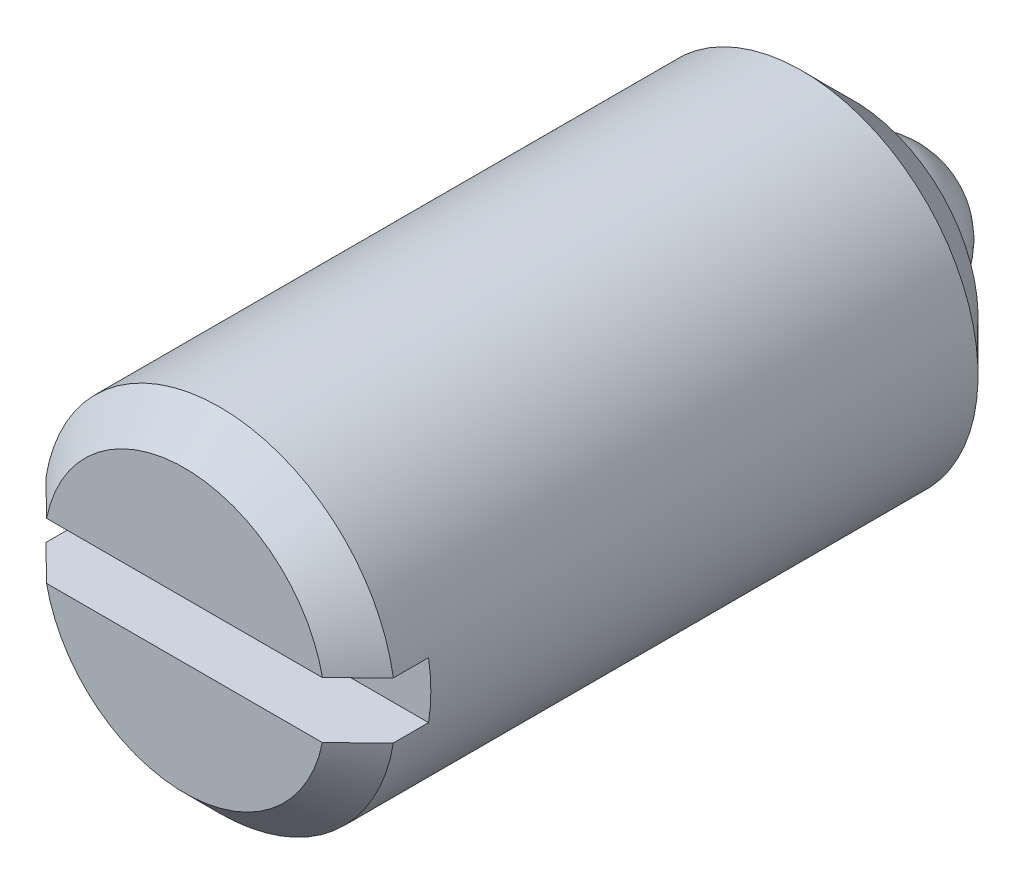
ISO-10303-21;
HEADER;
FILE_DESCRIPTION(('STEP AP214'),'2;1');
FILE_NAME('part.step','',(''),(''),'','','');
FILE_SCHEMA(('AUTOMOTIVE_DESIGN { 1 0 10303 214 1 1 1 1 }'));
ENDSEC;
DATA;
#1=APPLICATION_CONTEXT('core data for automotive mechanical design processes');
#2=APPLICATION_PROTOCOL_DEFINITION('international standard','automotive_design',2000,#1);
#3=PRODUCT_CONTEXT('',#1,'mechanical');
#4=PRODUCT('Part','Part','',(#3));
#5=PRODUCT_RELATED_PRODUCT_CATEGORY('part','',(#4));
#6=PRODUCT_DEFINITION_FORMATION('','',#4);
#7=PRODUCT_DEFINITION_CONTEXT('part definition',#1,'design');
#8=PRODUCT_DEFINITION('design','',#6,#7);
#9=PRODUCT_DEFINITION_SHAPE('','',#8);
#10=(LENGTH_UNIT() NAMED_UNIT(*) SI_UNIT(.MILLI.,.METRE.));
#11=(NAMED_UNIT(*) PLANE_ANGLE_UNIT() SI_UNIT($,.RADIAN.));
#12=(NAMED_UNIT(*) SI_UNIT($,.STERADIAN.) SOLID_ANGLE_UNIT());
#13=UNCERTAINTY_MEASURE_WITH_UNIT(LENGTH_MEASURE(1.E-05),#10,'distance_accuracy_value','');
#14=(GEOMETRIC_REPRESENTATION_CONTEXT(3) GLOBAL_UNCERTAINTY_ASSIGNED_CONTEXT((#13)) GLOBAL_UNIT_ASSIGNED_CONTEXT((#10,
#11,#12)) REPRESENTATION_CONTEXT('',''));
#15=CARTESIAN_POINT('',(0.,0.,0.));
#16=DIRECTION('',(0.,0.,1.));
#17=DIRECTION('',(1.,0.,0.));
#18=AXIS2_PLACEMENT_3D('',#15,#16,#17);
#19=CARTESIAN_POINT('',(0.,5.,21.5));
#20=DIRECTION('',(0.,0.,1.));
#21=DIRECTION('',(1.,0.,0.));
#22=AXIS2_PLACEMENT_3D('',#19,#20,#21);
#23=PLANE('',#22);
#24=DIRECTION('',(1.,0.,0.));
#25=VECTOR('',#24,1.);
#26=CARTESIAN_POINT('',(-4.93558507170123,0.8,21.5));
#27=LINE('',#26,#25);
#28=CARTESIAN_POINT('',(-3.91918358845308,0.8,21.5));
#29=VERTEX_POINT('',#28);
#30=CARTESIAN_POINT('',(3.91918358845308,0.8,21.5));
#31=VERTEX_POINT('',#30);
#32=EDGE_CURVE('E75',#29,#31,#27,.T.);
#33=ORIENTED_EDGE('',*,*,#32,.T.);
#34=CARTESIAN_POINT('',(0.,0.,21.5));
#35=DIRECTION('',(0.,0.,1.));
#36=DIRECTION('',(0.,1.,0.));
#37=AXIS2_PLACEMENT_3D('',#34,#35,#36);
#38=CIRCLE('',#37,4.);
#39=EDGE_CURVE('E9',#31,#29,#38,.T.);
#40=ORIENTED_EDGE('',*,*,#39,.T.);
#41=EDGE_LOOP('',(#33,#40));
#42=FACE_BOUND('',#41,.T.);
#43=ADVANCED_FACE('F14',(#42),#23,.T.);
#44=CARTESIAN_POINT('',(0.,0.,-4.5));
#45=DIRECTION('',(0.,0.,-1.));
#46=DIRECTION('',(-1.,0.,0.));
#47=AXIS2_PLACEMENT_3D('',#44,#45,#46);
#48=CYLINDRICAL_SURFACE('',#47,5.);
#49=CARTESIAN_POINT('',(0.,0.,3.95));
#50=DIRECTION('',(0.,0.,-1.));
#51=DIRECTION('',(0.,-1.,0.));
#52=AXIS2_PLACEMENT_3D('',#49,#50,#51);
#53=CIRCLE('',#52,5.);
#54=CARTESIAN_POINT('',(0.,-5.,3.95));
#55=VERTEX_POINT('',#54);
#56=EDGE_CURVE('E107',#55,#55,#53,.F.);
#57=ORIENTED_EDGE('',*,*,#56,.T.);
#58=EDGE_LOOP('',(#57));
#59=FACE_BOUND('',#58,.T.);
#60=DIRECTION('',(0.,0.,1.));
#61=VECTOR('',#60,1.);
#62=CARTESIAN_POINT('',(4.93558507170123,-0.8,19.5));
#63=LINE('',#62,#61);
#64=CARTESIAN_POINT('',(4.93558507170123,-0.8,19.5));
#65=VERTEX_POINT('',#64);
#66=CARTESIAN_POINT('',(4.93558507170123,-0.8,20.5));
#67=VERTEX_POINT('',#66);
#68=EDGE_CURVE('E83',#65,#67,#63,.T.);
#69=ORIENTED_EDGE('',*,*,#68,.T.);
#70=CARTESIAN_POINT('',(0.,0.,20.5));
#71=DIRECTION('',(0.,0.,1.));
#72=DIRECTION('',(0.,1.,0.));
#73=AXIS2_PLACEMENT_3D('',#70,#71,#72);
#74=CIRCLE('',#73,5.);
#75=CARTESIAN_POINT('',(-4.93558507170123,-0.8,20.5));
#76=VERTEX_POINT('',#75);
#77=EDGE_CURVE('E89',#67,#76,#74,.F.);
#78=ORIENTED_EDGE('',*,*,#77,.T.);
#79=DIRECTION('',(0.,0.,1.));
#80=VECTOR('',#79,1.);
#81=CARTESIAN_POINT('',(-4.93558507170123,-0.8,19.5));
#82=LINE('',#81,#80);
#83=CARTESIAN_POINT('',(-4.93558507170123,-0.8,19.5));
#84=VERTEX_POINT('',#83);
#85=EDGE_CURVE('E81',#84,#76,#82,.T.);
#86=ORIENTED_EDGE('',*,*,#85,.F.);
#87=CARTESIAN_POINT('',(0.,0.,19.5));
#88=DIRECTION('',(0.,0.,1.));
#89=DIRECTION('',(1.,0.,0.));
#90=AXIS2_PLACEMENT_3D('',#87,#88,#89);
#91=CIRCLE('',#90,5.);
#92=CARTESIAN_POINT('',(-4.93558507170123,0.8,19.5));
#93=VERTEX_POINT('',#92);
#94=EDGE_CURVE('E65',#93,#84,#91,.T.);
#95=ORIENTED_EDGE('',*,*,#94,.F.);
#96=DIRECTION('',(0.,0.,1.));
#97=VECTOR('',#96,1.);
#98=CARTESIAN_POINT('',(-4.93558507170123,0.8,19.5));
#99=LINE('',#98,#97);
#100=CARTESIAN_POINT('',(-4.93558507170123,0.8,20.5));
#101=VERTEX_POINT('',#100);
#102=EDGE_CURVE('E96',#93,#101,#99,.T.);
#103=ORIENTED_EDGE('',*,*,#102,.T.);
#104=CARTESIAN_POINT('',(0.,0.,20.5));
#105=DIRECTION('',(0.,0.,1.));
#106=DIRECTION('',(0.,1.,0.));
#107=AXIS2_PLACEMENT_3D('',#104,#105,#106);
#108=CIRCLE('',#107,5.);
#109=CARTESIAN_POINT('',(4.93558507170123,0.8,20.5));
#110=VERTEX_POINT('',#109);
#111=EDGE_CURVE('E110',#101,#110,#108,.F.);
#112=ORIENTED_EDGE('',*,*,#111,.T.);
#113=DIRECTION('',(0.,0.,1.));
#114=VECTOR('',#113,1.);
#115=CARTESIAN_POINT('',(4.93558507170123,0.8,19.5));
#116=LINE('',#115,#114);
#117=CARTESIAN_POINT('',(4.93558507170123,0.8,19.5));
#118=VERTEX_POINT('',#117);
#119=EDGE_CURVE('E91',#118,#110,#116,.T.);
#120=ORIENTED_EDGE('',*,*,#119,.F.);
#121=EDGE_CURVE('E77',#65,#118,#91,.T.);
#122=ORIENTED_EDGE('',*,*,#121,.F.);
#123=EDGE_LOOP('',(#69,#78,#86,#95,#103,#112,#120,#122));
#124=FACE_BOUND('',#123,.T.);
#125=ADVANCED_FACE('F87',(#59,#124),#48,.T.);
#126=CARTESIAN_POINT('',(0.,2.25,2.5));
#127=DIRECTION('',(0.,0.,-1.));
#128=DIRECTION('',(-1.,0.,0.));
#129=AXIS2_PLACEMENT_3D('',#126,#127,#128);
#130=PLANE('',#129);
#131=CARTESIAN_POINT('',(0.,0.,2.5));
#132=DIRECTION('',(0.,0.,-1.));
#133=DIRECTION('',(0.,-1.,0.));
#134=AXIS2_PLACEMENT_3D('',#131,#132,#133);
#135=CIRCLE('',#134,3.55);
#136=CARTESIAN_POINT('',(0.,-3.55,2.5));
#137=VERTEX_POINT('',#136);
#138=EDGE_CURVE('E104',#137,#137,#135,.T.);
#139=ORIENTED_EDGE('',*,*,#138,.T.);
#140=EDGE_LOOP('',(#139));
#141=FACE_BOUND('',#140,.T.);
#142=CARTESIAN_POINT('',(0.,0.,2.5));
#143=DIRECTION('',(0.,0.,-1.));
#144=DIRECTION('',(-1.,0.,0.));
#145=AXIS2_PLACEMENT_3D('',#142,#143,#144);
#146=CIRCLE('',#145,2.25);
#147=CARTESIAN_POINT('',(-2.25,0.,2.5));
#148=VERTEX_POINT('',#147);
#149=EDGE_CURVE('E101',#148,#148,#146,.T.);
#150=ORIENTED_EDGE('',*,*,#149,.F.);
#151=EDGE_LOOP('',(#150));
#152=FACE_BOUND('',#151,.T.);
#153=ADVANCED_FACE('F178',(#141,#152),#130,.T.);
#154=CARTESIAN_POINT('',(0.,0.,-4.5));
#155=DIRECTION('',(0.,0.,-1.));
#156=DIRECTION('',(-1.,0.,0.));
#157=AXIS2_PLACEMENT_3D('',#154,#155,#156);
#158=CYLINDRICAL_SURFACE('',#157,2.25);
#159=CARTESIAN_POINT('',(0.,0.,2.25));
#160=DIRECTION('',(0.,0.,-1.));
#161=DIRECTION('',(-1.,0.,0.));
#162=AXIS2_PLACEMENT_3D('',#159,#160,#161);
#163=CIRCLE('',#162,2.25);
#164=CARTESIAN_POINT('',(-2.25,0.,2.25));
#165=VERTEX_POINT('',#164);
#166=EDGE_CURVE('E98',#165,#165,#163,.T.);
#167=ORIENTED_EDGE('',*,*,#166,.F.);
#168=EDGE_LOOP('',(#167));
#169=FACE_BOUND('',#168,.T.);
#170=ORIENTED_EDGE('',*,*,#149,.T.);
#171=EDGE_LOOP('',(#170));
#172=FACE_BOUND('',#171,.T.);
#173=ADVANCED_FACE('F187',(#169,#172),#158,.T.);
#174=CARTESIAN_POINT('',(0.,0.,2.25));
#175=DIRECTION('',(-1.,0.,0.));
#176=DIRECTION('',(0.,0.,1.));
#177=AXIS2_PLACEMENT_3D('',#174,#175,#176);
#178=SPHERICAL_SURFACE('',#177,2.25);
#179=CARTESIAN_POINT('',(0.,0.,2.25));
#180=DIRECTION('',(0.,0.,-1.));
#181=DIRECTION('',(-1.,0.,0.));
#182=AXIS2_PLACEMENT_3D('',#179,#180,#181);
#183=SPHERICAL_SURFACE('',#182,2.25);
#184=ORIENTED_EDGE('',*,*,#166,.T.);
#185=EDGE_LOOP('',(#184));
#186=FACE_BOUND('',#185,.T.);
#187=ADVANCED_FACE('F182',(#186),#183,.T.);
#188=DIRECTION('',(1.,0.,0.));
#189=VECTOR('',#188,1.);
#190=CARTESIAN_POINT('',(-4.93558507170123,-0.8,21.5));
#191=LINE('',#190,#189);
#192=CARTESIAN_POINT('',(-3.91918358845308,-0.8,21.5));
#193=VERTEX_POINT('',#192);
#194=CARTESIAN_POINT('',(3.91918358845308,-0.8,21.5));
#195=VERTEX_POINT('',#194);
#196=EDGE_CURVE('E159',#193,#195,#191,.T.);
#197=ORIENTED_EDGE('',*,*,#196,.F.);
#198=CARTESIAN_POINT('',(0.,0.,21.5));
#199=DIRECTION('',(0.,0.,1.));
#200=DIRECTION('',(0.,1.,0.));
#201=AXIS2_PLACEMENT_3D('',#198,#199,#200);
#202=CIRCLE('',#201,4.);
#203=EDGE_CURVE('E153',#193,#195,#202,.T.);
#204=ORIENTED_EDGE('',*,*,#203,.T.);
#205=EDGE_LOOP('',(#197,#204));
#206=FACE_BOUND('',#205,.T.);
#207=ADVANCED_FACE('F140',(#206),#23,.T.);
#208=CARTESIAN_POINT('',(-4.93558507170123,0.8,19.5));
#209=DIRECTION('',(0.,-1.,0.));
#210=DIRECTION('',(1.,0.,0.));
#211=AXIS2_PLACEMENT_3D('',#208,#209,#210);
#212=PLANE('',#211);
#213=ORIENTED_EDGE('',*,*,#119,.T.);
#214=CARTESIAN_POINT('',(4.93558507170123,0.8,20.5));
#215=CARTESIAN_POINT('',(4.85102221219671,0.8,20.5834727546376));
#216=CARTESIAN_POINT('',(4.76643256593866,0.8,20.6669183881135));
#217=CARTESIAN_POINT('',(4.59718901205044,0.8,20.8337443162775));
#218=CARTESIAN_POINT('',(4.51253510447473,0.8,20.9171246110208));
#219=CARTESIAN_POINT('',(4.34315217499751,0.8,21.083808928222));
#220=CARTESIAN_POINT('',(4.25842315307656,0.8,21.1671129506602));
#221=CARTESIAN_POINT('',(4.08887483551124,0.8,21.3336292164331));
#222=CARTESIAN_POINT('',(4.00405553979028,0.8,21.4168414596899));
#223=CARTESIAN_POINT('',(3.91918358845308,0.8,21.5));
#224=B_SPLINE_CURVE_WITH_KNOTS('',3,(#214,#215,#216,#217,#218,#219,#220,#221,#222,#223),
.UNSPECIFIED.,.F.,.F.,(4,2,2,2,4),(0.,0.356464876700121,0.712929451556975,1.06939411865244,
1.42585908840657),.UNSPECIFIED.);
#225=EDGE_CURVE('E23',#110,#31,#224,.T.);
#226=ORIENTED_EDGE('',*,*,#225,.T.);
#227=ORIENTED_EDGE('',*,*,#32,.F.);
#228=CARTESIAN_POINT('',(-3.91918358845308,0.8,21.5));
#229=CARTESIAN_POINT('',(-4.00405553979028,0.8,21.4168414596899));
#230=CARTESIAN_POINT('',(-4.08887483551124,0.8,21.3336292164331));
#231=CARTESIAN_POINT('',(-4.25842315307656,0.8,21.1671129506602));
#232=CARTESIAN_POINT('',(-4.34315217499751,0.8,21.083808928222));
#233=CARTESIAN_POINT('',(-4.51253510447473,0.8,20.9171246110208));
#234=CARTESIAN_POINT('',(-4.59718901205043,0.8,20.8337443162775));
#235=CARTESIAN_POINT('',(-4.76643256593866,0.8,20.6669183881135));
#236=CARTESIAN_POINT('',(-4.85102221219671,0.8,20.5834727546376));
#237=CARTESIAN_POINT('',(-4.93558507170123,0.8,20.5));
#238=B_SPLINE_CURVE_WITH_KNOTS('',3,(#228,#229,#230,#231,#232,#233,#234,#235,#236,#237),
.UNSPECIFIED.,.F.,.F.,(4,2,2,2,4),(0.,0.356464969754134,0.712929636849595,1.06939421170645,
1.42585908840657),.UNSPECIFIED.);
#239=EDGE_CURVE('E144',#29,#101,#238,.T.);
#240=ORIENTED_EDGE('',*,*,#239,.T.);
#241=ORIENTED_EDGE('',*,*,#102,.F.);
#242=DIRECTION('',(1.,0.,0.));
#243=VECTOR('',#242,1.);
#244=CARTESIAN_POINT('',(-4.93558507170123,0.8,19.5));
#245=LINE('',#244,#243);
#246=EDGE_CURVE('E71',#93,#118,#245,.T.);
#247=ORIENTED_EDGE('',*,*,#246,.T.);
#248=EDGE_LOOP('',(#213,#226,#227,#240,#241,#247));
#249=FACE_BOUND('',#248,.T.);
#250=ADVANCED_FACE('F134',(#249),#212,.T.);
#251=CARTESIAN_POINT('',(-4.93558507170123,-0.8,19.5));
#252=DIRECTION('',(0.,-1.,0.));
#253=DIRECTION('',(1.,0.,0.));
#254=AXIS2_PLACEMENT_3D('',#251,#252,#253);
#255=PLANE('',#254);
#256=ORIENTED_EDGE('',*,*,#85,.T.);
#257=CARTESIAN_POINT('',(-4.93558507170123,-0.8,20.5));
#258=CARTESIAN_POINT('',(-4.85102221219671,-0.8,20.5834727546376));
#259=CARTESIAN_POINT('',(-4.76643256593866,-0.8,20.6669183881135));
#260=CARTESIAN_POINT('',(-4.59718901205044,-0.8,20.8337443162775));
#261=CARTESIAN_POINT('',(-4.51253510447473,-0.8,20.9171246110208));
#262=CARTESIAN_POINT('',(-4.34315217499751,-0.8,21.083808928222));
#263=CARTESIAN_POINT('',(-4.25842315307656,-0.8,21.1671129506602));
#264=CARTESIAN_POINT('',(-4.08887483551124,-0.8,21.3336292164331));
#265=CARTESIAN_POINT('',(-4.00405553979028,-0.8,21.4168414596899));
#266=CARTESIAN_POINT('',(-3.91918358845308,-0.8,21.5));
#267=B_SPLINE_CURVE_WITH_KNOTS('',3,(#257,#258,#259,#260,#261,#262,#263,#264,#265,#266),
.UNSPECIFIED.,.F.,.F.,(4,2,2,2,4),(0.,0.356464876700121,0.712929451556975,1.06939411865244,
1.42585908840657),.UNSPECIFIED.);
#268=EDGE_CURVE('E121',#76,#193,#267,.T.);
#269=ORIENTED_EDGE('',*,*,#268,.T.);
#270=ORIENTED_EDGE('',*,*,#196,.T.);
#271=CARTESIAN_POINT('',(3.91918358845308,-0.8,21.5));
#272=CARTESIAN_POINT('',(4.00405553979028,-0.8,21.4168414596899));
#273=CARTESIAN_POINT('',(4.08887483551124,-0.8,21.3336292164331));
#274=CARTESIAN_POINT('',(4.25842315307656,-0.8,21.1671129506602));
#275=CARTESIAN_POINT('',(4.34315217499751,-0.8,21.083808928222));
#276=CARTESIAN_POINT('',(4.51253510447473,-0.8,20.9171246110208));
#277=CARTESIAN_POINT('',(4.59718901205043,-0.8,20.8337443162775));
#278=CARTESIAN_POINT('',(4.76643256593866,-0.8,20.6669183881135));
#279=CARTESIAN_POINT('',(4.85102221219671,-0.8,20.5834727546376));
#280=CARTESIAN_POINT('',(4.93558507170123,-0.8,20.5));
#281=B_SPLINE_CURVE_WITH_KNOTS('',3,(#271,#272,#273,#274,#275,#276,#277,#278,#279,#280),
.UNSPECIFIED.,.F.,.F.,(4,2,2,2,4),(0.,0.356464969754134,0.712929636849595,1.06939421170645,
1.42585908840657),.UNSPECIFIED.);
#282=EDGE_CURVE('E114',#195,#67,#281,.T.);
#283=ORIENTED_EDGE('',*,*,#282,.T.);
#284=ORIENTED_EDGE('',*,*,#68,.F.);
#285=DIRECTION('',(1.,0.,0.));
#286=VECTOR('',#285,1.);
#287=CARTESIAN_POINT('',(-4.93558507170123,-0.8,19.5));
#288=LINE('',#287,#286);
#289=EDGE_CURVE('E68',#84,#65,#288,.T.);
#290=ORIENTED_EDGE('',*,*,#289,.F.);
#291=EDGE_LOOP('',(#256,#269,#270,#283,#284,#290));
#292=FACE_BOUND('',#291,.T.);
#293=ADVANCED_FACE('F80',(#292),#255,.F.);
#294=CARTESIAN_POINT('',(0.,0.,19.5));
#295=DIRECTION('',(0.,0.,1.));
#296=DIRECTION('',(1.,0.,0.));
#297=AXIS2_PLACEMENT_3D('',#294,#295,#296);
#298=PLANE('',#297);
#299=ORIENTED_EDGE('',*,*,#94,.T.);
#300=ORIENTED_EDGE('',*,*,#289,.T.);
#301=ORIENTED_EDGE('',*,*,#121,.T.);
#302=ORIENTED_EDGE('',*,*,#246,.F.);
#303=EDGE_LOOP('',(#299,#300,#301,#302));
#304=FACE_BOUND('',#303,.T.);
#305=ADVANCED_FACE('F67',(#304),#298,.T.);
#306=CARTESIAN_POINT('',(0.,0.,2.5));
#307=DIRECTION('',(0.,0.,1.));
#308=DIRECTION('',(0.,1.,0.));
#309=AXIS2_PLACEMENT_3D('',#306,#307,#308);
#310=CONICAL_SURFACE('',#309,3.55,0.785398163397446);
#311=ORIENTED_EDGE('',*,*,#56,.F.);
#312=EDGE_LOOP('',(#311));
#313=FACE_BOUND('',#312,.T.);
#314=ORIENTED_EDGE('',*,*,#138,.F.);
#315=EDGE_LOOP('',(#314));
#316=FACE_BOUND('',#315,.T.);
#317=ADVANCED_FACE('F135',(#313,#316),#310,.T.);
#318=CARTESIAN_POINT('',(0.,0.,20.5));
#319=DIRECTION('',(0.,0.,-1.));
#320=DIRECTION('',(0.,-1.,0.));
#321=AXIS2_PLACEMENT_3D('',#318,#319,#320);
#322=CONICAL_SURFACE('',#321,5.,0.78539816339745);
#323=ORIENTED_EDGE('',*,*,#282,.F.);
#324=ORIENTED_EDGE('',*,*,#203,.F.);
#325=ORIENTED_EDGE('',*,*,#268,.F.);
#326=ORIENTED_EDGE('',*,*,#77,.F.);
#327=EDGE_LOOP('',(#323,#324,#325,#326));
#328=FACE_BOUND('',#327,.T.);
#329=ADVANCED_FACE('F127',(#328),#322,.T.);
#330=CARTESIAN_POINT('',(0.,0.,20.5));
#331=DIRECTION('',(0.,0.,-1.));
#332=DIRECTION('',(0.,-1.,0.));
#333=AXIS2_PLACEMENT_3D('',#330,#331,#332);
#334=CONICAL_SURFACE('',#333,5.,0.78539816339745);
#335=ORIENTED_EDGE('',*,*,#239,.F.);
#336=ORIENTED_EDGE('',*,*,#39,.F.);
#337=ORIENTED_EDGE('',*,*,#225,.F.);
#338=ORIENTED_EDGE('',*,*,#111,.F.);
#339=EDGE_LOOP('',(#335,#336,#337,#338));
#340=FACE_BOUND('',#339,.T.);
#341=ADVANCED_FACE('F16',(#340),#334,.T.);
#342=CLOSED_SHELL('',(#43,#125,#153,#173,#187,#207,#250,#293,#305,#317,#329,#341));
#343=MANIFOLD_SOLID_BREP('B1',#342);
#344=ADVANCED_BREP_SHAPE_REPRESENTATION('',(#18,#343),#14);
#345=SHAPE_DEFINITION_REPRESENTATION(#9,#344);
ENDSEC;
END-ISO-10303-21;
